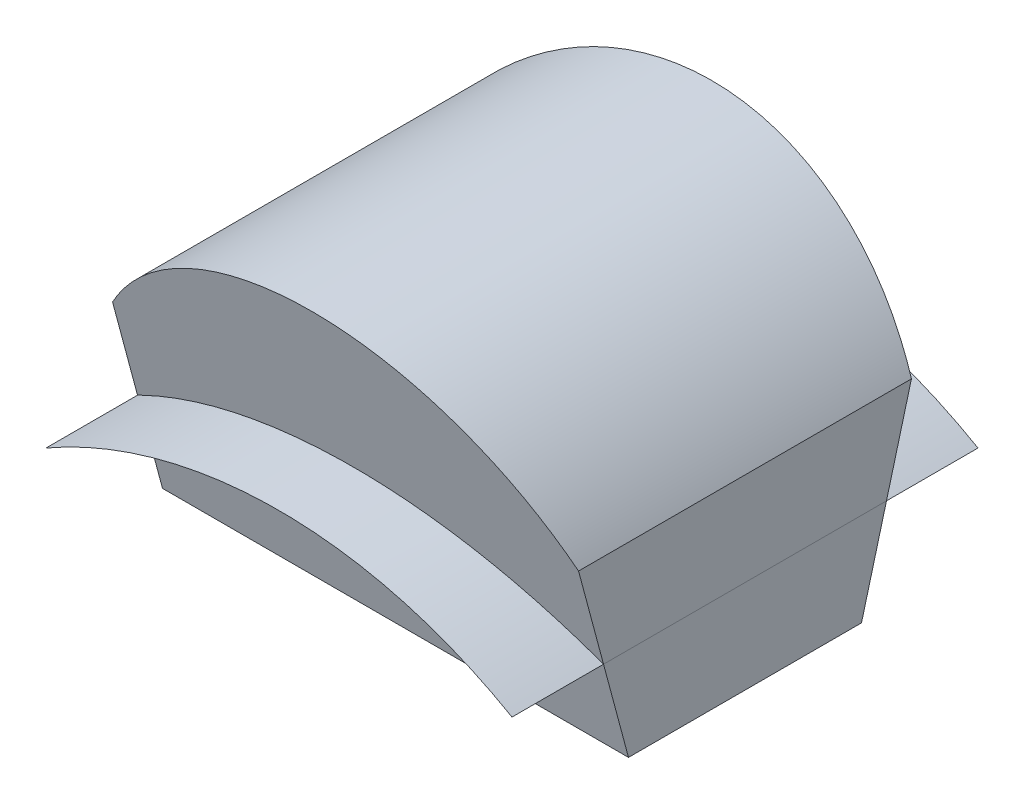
ISO-10303-21;
HEADER;
FILE_DESCRIPTION(('STEP AP214'),'2;1');
FILE_NAME('part.step','',(''),(''),'','','');
FILE_SCHEMA(('AUTOMOTIVE_DESIGN { 1 0 10303 214 1 1 1 1 }'));
ENDSEC;
DATA;
#1=APPLICATION_CONTEXT('core data for automotive mechanical design processes');
#2=APPLICATION_PROTOCOL_DEFINITION('international standard','automotive_design',2000,#1);
#3=PRODUCT_CONTEXT('',#1,'mechanical');
#4=PRODUCT('Part','Part','',(#3));
#5=PRODUCT_RELATED_PRODUCT_CATEGORY('part','',(#4));
#6=PRODUCT_DEFINITION_FORMATION('','',#4);
#7=PRODUCT_DEFINITION_CONTEXT('part definition',#1,'design');
#8=PRODUCT_DEFINITION('design','',#6,#7);
#9=PRODUCT_DEFINITION_SHAPE('','',#8);
#10=(LENGTH_UNIT() NAMED_UNIT(*) SI_UNIT(.MILLI.,.METRE.));
#11=(NAMED_UNIT(*) PLANE_ANGLE_UNIT() SI_UNIT($,.RADIAN.));
#12=(NAMED_UNIT(*) SI_UNIT($,.STERADIAN.) SOLID_ANGLE_UNIT());
#13=UNCERTAINTY_MEASURE_WITH_UNIT(LENGTH_MEASURE(1.E-05),#10,'distance_accuracy_value','');
#14=(GEOMETRIC_REPRESENTATION_CONTEXT(3) GLOBAL_UNCERTAINTY_ASSIGNED_CONTEXT((#13)) GLOBAL_UNIT_ASSIGNED_CONTEXT((#10,
#11,#12)) REPRESENTATION_CONTEXT('',''));
#15=CARTESIAN_POINT('',(0.,0.,0.));
#16=DIRECTION('',(0.,0.,1.));
#17=DIRECTION('',(1.,0.,0.));
#18=AXIS2_PLACEMENT_3D('',#15,#16,#17);
#19=CARTESIAN_POINT('',(0.,-66.6025403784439,-50.));
#20=DIRECTION('',(0.,0.,1.));
#21=DIRECTION('',(1.,0.,0.));
#22=AXIS2_PLACEMENT_3D('',#19,#20,#21);
#23=CYLINDRICAL_SURFACE('',#22,100.);
#24=DIRECTION('',(0.,0.,1.));
#25=VECTOR('',#24,1.);
#26=CARTESIAN_POINT('',(50.,20.,-50.));
#27=LINE('',#26,#25);
#28=CARTESIAN_POINT('',(50.,20.,-30.3589838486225));
#29=VERTEX_POINT('',#28);
#30=CARTESIAN_POINT('',(50.,20.,30.3589838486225));
#31=VERTEX_POINT('',#30);
#32=EDGE_CURVE('E136',#29,#31,#27,.T.);
#33=ORIENTED_EDGE('',*,*,#32,.T.);
#34=CARTESIAN_POINT('',(0.,-66.6025403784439,7.15390309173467));
#35=DIRECTION('',(0.,-0.258819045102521,0.965925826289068));
#36=DIRECTION('',(0.,0.965925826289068,0.258819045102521));
#37=AXIS2_PLACEMENT_3D('',#34,#35,#36);
#38=ELLIPSE('',#37,103.527618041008,100.);
#39=CARTESIAN_POINT('',(-50.,20.,30.3589838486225));
#40=VERTEX_POINT('',#39);
#41=EDGE_CURVE('E205',#31,#40,#38,.T.);
#42=ORIENTED_EDGE('',*,*,#41,.T.);
#43=DIRECTION('',(0.,0.,1.));
#44=VECTOR('',#43,1.);
#45=CARTESIAN_POINT('',(-50.,20.,-50.));
#46=LINE('',#45,#44);
#47=CARTESIAN_POINT('',(-50.,20.,-30.3589838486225));
#48=VERTEX_POINT('',#47);
#49=EDGE_CURVE('E201',#40,#48,#46,.F.);
#50=ORIENTED_EDGE('',*,*,#49,.T.);
#51=CARTESIAN_POINT('',(0.,-66.6025403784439,-7.15390309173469));
#52=DIRECTION('',(0.,-0.258819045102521,-0.965925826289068));
#53=DIRECTION('',(0.,-0.965925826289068,0.258819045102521));
#54=AXIS2_PLACEMENT_3D('',#51,#52,#53);
#55=ELLIPSE('',#54,103.527618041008,100.);
#56=EDGE_CURVE('E199',#29,#48,#55,.F.);
#57=ORIENTED_EDGE('',*,*,#56,.F.);
#58=EDGE_LOOP('',(#33,#42,#50,#57));
#59=FACE_BOUND('',#58,.T.);
#60=CARTESIAN_POINT('',(0.,-66.6025403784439,-6.1186269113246));
#61=DIRECTION('',(0.,-0.258819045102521,-0.965925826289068));
#62=DIRECTION('',(0.,-0.965925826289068,0.258819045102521));
#63=AXIS2_PLACEMENT_3D('',#60,#61,#62);
#64=ELLIPSE('',#63,103.527618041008,100.);
#65=CARTESIAN_POINT('',(-49.,20.5697029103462,-29.4763591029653));
#66=VERTEX_POINT('',#65);
#67=CARTESIAN_POINT('',(49.,20.5697029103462,-29.4763591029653));
#68=VERTEX_POINT('',#67);
#69=EDGE_CURVE('E187',#66,#68,#64,.T.);
#70=ORIENTED_EDGE('',*,*,#69,.F.);
#71=DIRECTION('',(0.,0.,1.));
#72=VECTOR('',#71,1.);
#73=CARTESIAN_POINT('',(-49.,20.5697029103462,-50.));
#74=LINE('',#73,#72);
#75=CARTESIAN_POINT('',(-49.,20.5697029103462,29.4763591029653));
#76=VERTEX_POINT('',#75);
#77=EDGE_CURVE('E183',#66,#76,#74,.T.);
#78=ORIENTED_EDGE('',*,*,#77,.T.);
#79=CARTESIAN_POINT('',(0.,-66.6025403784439,6.11862691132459));
#80=DIRECTION('',(0.,-0.258819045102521,0.965925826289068));
#81=DIRECTION('',(0.,0.965925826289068,0.258819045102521));
#82=AXIS2_PLACEMENT_3D('',#79,#80,#81);
#83=ELLIPSE('',#82,103.527618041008,100.);
#84=CARTESIAN_POINT('',(49.,20.5697029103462,29.4763591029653));
#85=VERTEX_POINT('',#84);
#86=EDGE_CURVE('E175',#76,#85,#83,.F.);
#87=ORIENTED_EDGE('',*,*,#86,.T.);
#88=DIRECTION('',(0.,0.,1.));
#89=VECTOR('',#88,1.);
#90=CARTESIAN_POINT('',(49.,20.5697029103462,-50.));
#91=LINE('',#90,#89);
#92=EDGE_CURVE('E179',#85,#68,#91,.F.);
#93=ORIENTED_EDGE('',*,*,#92,.T.);
#94=EDGE_LOOP('',(#70,#78,#87,#93));
#95=FACE_BOUND('',#94,.T.);
#96=ADVANCED_FACE('F51',(#59,#95),#23,.F.);
#97=CARTESIAN_POINT('',(0.,-66.6025403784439,-50.));
#98=DIRECTION('',(0.,0.,1.));
#99=DIRECTION('',(1.,0.,0.));
#100=AXIS2_PLACEMENT_3D('',#97,#98,#99);
#101=CYLINDRICAL_SURFACE('',#100,101.);
#102=DIRECTION('',(0.,0.,1.));
#103=VECTOR('',#102,1.);
#104=CARTESIAN_POINT('',(-49.,21.7150682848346,-50.));
#105=LINE('',#104,#103);
#106=CARTESIAN_POINT('',(-49.,21.7150682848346,29.783258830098));
#107=VERTEX_POINT('',#106);
#108=CARTESIAN_POINT('',(-49.,21.7150682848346,-29.7832588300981));
#109=VERTEX_POINT('',#108);
#110=EDGE_CURVE('E163',#107,#109,#105,.F.);
#111=ORIENTED_EDGE('',*,*,#110,.T.);
#112=CARTESIAN_POINT('',(0.,-66.6025403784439,-6.1186269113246));
#113=DIRECTION('',(0.,-0.258819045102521,-0.965925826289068));
#114=DIRECTION('',(0.,-0.965925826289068,0.258819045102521));
#115=AXIS2_PLACEMENT_3D('',#112,#113,#114);
#116=ELLIPSE('',#115,104.562894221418,101.);
#117=CARTESIAN_POINT('',(49.,21.7150682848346,-29.7832588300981));
#118=VERTEX_POINT('',#117);
#119=EDGE_CURVE('E160',#118,#109,#116,.F.);
#120=ORIENTED_EDGE('',*,*,#119,.F.);
#121=DIRECTION('',(0.,0.,1.));
#122=VECTOR('',#121,1.);
#123=CARTESIAN_POINT('',(49.,21.7150682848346,-50.));
#124=LINE('',#123,#122);
#125=CARTESIAN_POINT('',(49.,21.7150682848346,29.7832588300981));
#126=VERTEX_POINT('',#125);
#127=EDGE_CURVE('E167',#118,#126,#124,.T.);
#128=ORIENTED_EDGE('',*,*,#127,.T.);
#129=CARTESIAN_POINT('',(0.,-66.6025403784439,6.11862691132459));
#130=DIRECTION('',(0.,-0.258819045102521,0.965925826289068));
#131=DIRECTION('',(0.,0.965925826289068,0.258819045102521));
#132=AXIS2_PLACEMENT_3D('',#129,#130,#131);
#133=ELLIPSE('',#132,104.562894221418,101.);
#134=EDGE_CURVE('E171',#126,#107,#133,.T.);
#135=ORIENTED_EDGE('',*,*,#134,.T.);
#136=EDGE_LOOP('',(#111,#120,#128,#135));
#137=FACE_BOUND('',#136,.T.);
#138=CARTESIAN_POINT('',(0.,-66.6025403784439,5.08335073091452));
#139=DIRECTION('',(0.,-0.258819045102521,0.965925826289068));
#140=DIRECTION('',(0.,0.965925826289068,0.258819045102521));
#141=AXIS2_PLACEMENT_3D('',#138,#139,#140);
#142=ELLIPSE('',#141,104.562894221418,101.);
#143=CARTESIAN_POINT('',(48.,22.2625258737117,28.8946734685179));
#144=VERTEX_POINT('',#143);
#145=CARTESIAN_POINT('',(-48.,22.2625258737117,28.8946734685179));
#146=VERTEX_POINT('',#145);
#147=EDGE_CURVE('E190',#144,#146,#142,.T.);
#148=ORIENTED_EDGE('',*,*,#147,.F.);
#149=DIRECTION('',(0.,0.,1.));
#150=VECTOR('',#149,1.);
#151=CARTESIAN_POINT('',(48.,22.2625258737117,-50.));
#152=LINE('',#151,#150);
#153=CARTESIAN_POINT('',(48.,22.2625258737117,-28.8946734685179));
#154=VERTEX_POINT('',#153);
#155=EDGE_CURVE('E193',#154,#144,#152,.T.);
#156=ORIENTED_EDGE('',*,*,#155,.F.);
#157=CARTESIAN_POINT('',(0.,-66.6025403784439,-5.08335073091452));
#158=DIRECTION('',(0.,-0.258819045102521,-0.965925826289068));
#159=DIRECTION('',(0.,-0.965925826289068,0.258819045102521));
#160=AXIS2_PLACEMENT_3D('',#157,#158,#159);
#161=ELLIPSE('',#160,104.562894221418,101.);
#162=CARTESIAN_POINT('',(-48.,22.2625258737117,-28.8946734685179));
#163=VERTEX_POINT('',#162);
#164=EDGE_CURVE('E208',#154,#163,#161,.F.);
#165=ORIENTED_EDGE('',*,*,#164,.T.);
#166=DIRECTION('',(0.,0.,1.));
#167=VECTOR('',#166,1.);
#168=CARTESIAN_POINT('',(-48.,22.2625258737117,-50.));
#169=LINE('',#168,#167);
#170=EDGE_CURVE('E196',#146,#163,#169,.F.);
#171=ORIENTED_EDGE('',*,*,#170,.F.);
#172=EDGE_LOOP('',(#148,#156,#165,#171));
#173=FACE_BOUND('',#172,.T.);
#174=ADVANCED_FACE('F248',(#137,#173),#101,.F.);
#175=CARTESIAN_POINT('',(-49.,0.,25.));
#176=DIRECTION('',(1.,0.,0.));
#177=DIRECTION('',(0.,0.,-1.));
#178=AXIS2_PLACEMENT_3D('',#175,#176,#177);
#179=PLANE('',#178);
#180=DIRECTION('',(0.,0.965925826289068,0.258819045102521));
#181=VECTOR('',#180,1.);
#182=CARTESIAN_POINT('',(-49.,0.258819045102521,24.0340741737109));
#183=LINE('',#182,#181);
#184=EDGE_CURVE('E12',#107,#76,#183,.F.);
#185=ORIENTED_EDGE('',*,*,#184,.T.);
#186=ORIENTED_EDGE('',*,*,#77,.F.);
#187=DIRECTION('',(0.,-0.965925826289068,0.258819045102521));
#188=VECTOR('',#187,1.);
#189=CARTESIAN_POINT('',(-49.,0.258819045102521,-24.0340741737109));
#190=LINE('',#189,#188);
#191=EDGE_CURVE('E158',#109,#66,#190,.T.);
#192=ORIENTED_EDGE('',*,*,#191,.F.);
#193=ORIENTED_EDGE('',*,*,#110,.F.);
#194=EDGE_LOOP('',(#185,#186,#192,#193));
#195=FACE_BOUND('',#194,.T.);
#196=ADVANCED_FACE('F246',(#195),#179,.T.);
#197=CARTESIAN_POINT('',(-50.,0.258819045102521,-24.0340741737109));
#198=DIRECTION('',(0.,-0.258819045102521,-0.965925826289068));
#199=DIRECTION('',(0.,0.965925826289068,-0.258819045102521));
#200=AXIS2_PLACEMENT_3D('',#197,#198,#199);
#201=PLANE('',#200);
#202=ORIENTED_EDGE('',*,*,#119,.T.);
#203=ORIENTED_EDGE('',*,*,#191,.T.);
#204=ORIENTED_EDGE('',*,*,#69,.T.);
#205=DIRECTION('',(0.,0.965925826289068,-0.258819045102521));
#206=VECTOR('',#205,1.);
#207=CARTESIAN_POINT('',(49.,0.258819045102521,-24.0340741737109));
#208=LINE('',#207,#206);
#209=EDGE_CURVE('E70',#68,#118,#208,.T.);
#210=ORIENTED_EDGE('',*,*,#209,.T.);
#211=EDGE_LOOP('',(#202,#203,#204,#210));
#212=FACE_BOUND('',#211,.T.);
#213=ADVANCED_FACE('F255',(#212),#201,.F.);
#214=CARTESIAN_POINT('',(49.,0.,25.));
#215=DIRECTION('',(-1.,0.,0.));
#216=DIRECTION('',(0.,0.,1.));
#217=AXIS2_PLACEMENT_3D('',#214,#215,#216);
#218=PLANE('',#217);
#219=ORIENTED_EDGE('',*,*,#209,.F.);
#220=ORIENTED_EDGE('',*,*,#92,.F.);
#221=DIRECTION('',(0.,-0.965925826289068,-0.258819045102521));
#222=VECTOR('',#221,1.);
#223=CARTESIAN_POINT('',(49.,0.258819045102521,24.0340741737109));
#224=LINE('',#223,#222);
#225=EDGE_CURVE('E61',#85,#126,#224,.F.);
#226=ORIENTED_EDGE('',*,*,#225,.T.);
#227=ORIENTED_EDGE('',*,*,#127,.F.);
#228=EDGE_LOOP('',(#219,#220,#226,#227));
#229=FACE_BOUND('',#228,.T.);
#230=ADVANCED_FACE('F252',(#229),#218,.T.);
#231=CARTESIAN_POINT('',(-50.,0.258819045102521,24.0340741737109));
#232=DIRECTION('',(0.,-0.258819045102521,0.965925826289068));
#233=DIRECTION('',(0.,-0.965925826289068,-0.258819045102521));
#234=AXIS2_PLACEMENT_3D('',#231,#232,#233);
#235=PLANE('',#234);
#236=ORIENTED_EDGE('',*,*,#225,.F.);
#237=ORIENTED_EDGE('',*,*,#86,.F.);
#238=ORIENTED_EDGE('',*,*,#184,.F.);
#239=ORIENTED_EDGE('',*,*,#134,.F.);
#240=EDGE_LOOP('',(#236,#237,#238,#239));
#241=FACE_BOUND('',#240,.T.);
#242=ADVANCED_FACE('F243',(#241),#235,.F.);
#243=CARTESIAN_POINT('',(-48.,0.,25.));
#244=DIRECTION('',(1.,0.,0.));
#245=DIRECTION('',(0.,0.,-1.));
#246=AXIS2_PLACEMENT_3D('',#243,#244,#245);
#247=PLANE('',#246);
#248=DIRECTION('',(0.,0.965925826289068,0.258819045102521));
#249=VECTOR('',#248,1.);
#250=CARTESIAN_POINT('',(-48.,0.517638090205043,23.0681483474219));
#251=LINE('',#250,#249);
#252=CARTESIAN_POINT('',(-48.,39.3913932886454,33.4843396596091));
#253=VERTEX_POINT('',#252);
#254=EDGE_CURVE('E213',#253,#146,#251,.F.);
#255=ORIENTED_EDGE('',*,*,#254,.T.);
#256=ORIENTED_EDGE('',*,*,#170,.T.);
#257=DIRECTION('',(0.,-0.965925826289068,0.258819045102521));
#258=VECTOR('',#257,1.);
#259=CARTESIAN_POINT('',(-48.,0.517638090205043,-23.0681483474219));
#260=LINE('',#259,#258);
#261=CARTESIAN_POINT('',(-48.,39.3913932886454,-33.4843396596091));
#262=VERTEX_POINT('',#261);
#263=EDGE_CURVE('E141',#262,#163,#260,.T.);
#264=ORIENTED_EDGE('',*,*,#263,.F.);
#265=DIRECTION('',(0.,0.,-1.));
#266=VECTOR('',#265,1.);
#267=CARTESIAN_POINT('',(-48.,39.3913932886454,33.4843396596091));
#268=LINE('',#267,#266);
#269=EDGE_CURVE('E219',#253,#262,#268,.T.);
#270=ORIENTED_EDGE('',*,*,#269,.F.);
#271=EDGE_LOOP('',(#255,#256,#264,#270));
#272=FACE_BOUND('',#271,.T.);
#273=ADVANCED_FACE('F270',(#272),#247,.T.);
#274=CARTESIAN_POINT('',(48.,0.,25.));
#275=DIRECTION('',(-1.,0.,0.));
#276=DIRECTION('',(0.,0.,1.));
#277=AXIS2_PLACEMENT_3D('',#274,#275,#276);
#278=PLANE('',#277);
#279=DIRECTION('',(0.,0.965925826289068,-0.258819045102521));
#280=VECTOR('',#279,1.);
#281=CARTESIAN_POINT('',(48.,0.517638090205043,-23.0681483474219));
#282=LINE('',#281,#280);
#283=CARTESIAN_POINT('',(48.,39.3913932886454,-33.4843396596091));
#284=VERTEX_POINT('',#283);
#285=EDGE_CURVE('E217',#154,#284,#282,.T.);
#286=ORIENTED_EDGE('',*,*,#285,.F.);
#287=ORIENTED_EDGE('',*,*,#155,.T.);
#288=DIRECTION('',(0.,-0.965925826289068,-0.258819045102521));
#289=VECTOR('',#288,1.);
#290=CARTESIAN_POINT('',(48.,0.517638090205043,23.0681483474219));
#291=LINE('',#290,#289);
#292=CARTESIAN_POINT('',(48.,39.3913932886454,33.4843396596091));
#293=VERTEX_POINT('',#292);
#294=EDGE_CURVE('E211',#144,#293,#291,.F.);
#295=ORIENTED_EDGE('',*,*,#294,.T.);
#296=DIRECTION('',(0.,0.,-1.));
#297=VECTOR('',#296,1.);
#298=CARTESIAN_POINT('',(48.,39.3913932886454,33.4843396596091));
#299=LINE('',#298,#297);
#300=EDGE_CURVE('E216',#293,#284,#299,.T.);
#301=ORIENTED_EDGE('',*,*,#300,.T.);
#302=EDGE_LOOP('',(#286,#287,#295,#301));
#303=FACE_BOUND('',#302,.T.);
#304=ADVANCED_FACE('F272',(#303),#278,.T.);
#305=CARTESIAN_POINT('',(0.,6.83375209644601,25.));
#306=DIRECTION('',(0.,0.,-1.));
#307=DIRECTION('',(-1.,0.,0.));
#308=AXIS2_PLACEMENT_3D('',#305,#306,#307);
#309=CYLINDRICAL_SURFACE('',#308,58.);
#310=CARTESIAN_POINT('',(0.,6.83375209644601,-24.760545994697));
#311=DIRECTION('',(0.,-0.258819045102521,-0.965925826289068));
#312=DIRECTION('',(0.,0.965925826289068,-0.258819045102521));
#313=AXIS2_PLACEMENT_3D('',#310,#311,#312);
#314=ELLIPSE('',#313,60.0460184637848,58.);
#315=EDGE_CURVE('E220',#284,#262,#314,.F.);
#316=ORIENTED_EDGE('',*,*,#315,.F.);
#317=ORIENTED_EDGE('',*,*,#300,.F.);
#318=CARTESIAN_POINT('',(0.,6.83375209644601,24.760545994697));
#319=DIRECTION('',(0.,-0.258819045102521,0.965925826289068));
#320=DIRECTION('',(0.,-0.965925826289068,-0.258819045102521));
#321=AXIS2_PLACEMENT_3D('',#318,#319,#320);
#322=ELLIPSE('',#321,60.0460184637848,58.);
#323=EDGE_CURVE('E192',#293,#253,#322,.T.);
#324=ORIENTED_EDGE('',*,*,#323,.T.);
#325=ORIENTED_EDGE('',*,*,#269,.T.);
#326=EDGE_LOOP('',(#316,#317,#324,#325));
#327=FACE_BOUND('',#326,.T.);
#328=ADVANCED_FACE('F279',(#327),#309,.F.);
#329=CARTESIAN_POINT('',(-50.,0.517638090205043,23.0681483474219));
#330=DIRECTION('',(0.,-0.258819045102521,0.965925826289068));
#331=DIRECTION('',(0.,-0.965925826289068,-0.258819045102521));
#332=AXIS2_PLACEMENT_3D('',#329,#330,#331);
#333=PLANE('',#332);
#334=ORIENTED_EDGE('',*,*,#294,.F.);
#335=ORIENTED_EDGE('',*,*,#147,.T.);
#336=ORIENTED_EDGE('',*,*,#254,.F.);
#337=ORIENTED_EDGE('',*,*,#323,.F.);
#338=EDGE_LOOP('',(#334,#335,#336,#337));
#339=FACE_BOUND('',#338,.T.);
#340=ADVANCED_FACE('F286',(#339),#333,.F.);
#341=CARTESIAN_POINT('',(-50.,0.517638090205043,-23.0681483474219));
#342=DIRECTION('',(0.,-0.258819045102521,-0.965925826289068));
#343=DIRECTION('',(0.,0.965925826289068,-0.258819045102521));
#344=AXIS2_PLACEMENT_3D('',#341,#342,#343);
#345=PLANE('',#344);
#346=ORIENTED_EDGE('',*,*,#164,.F.);
#347=ORIENTED_EDGE('',*,*,#285,.T.);
#348=ORIENTED_EDGE('',*,*,#315,.T.);
#349=ORIENTED_EDGE('',*,*,#263,.T.);
#350=EDGE_LOOP('',(#346,#347,#348,#349));
#351=FACE_BOUND('',#350,.T.);
#352=ADVANCED_FACE('F267',(#351),#345,.F.);
#353=CARTESIAN_POINT('',(0.,6.83375209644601,25.));
#354=DIRECTION('',(0.,0.,-1.));
#355=DIRECTION('',(-1.,0.,0.));
#356=AXIS2_PLACEMENT_3D('',#353,#354,#355);
#357=CYLINDRICAL_SURFACE('',#356,60.);
#358=CARTESIAN_POINT('',(0.,6.83375209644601,-26.8310983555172));
#359=DIRECTION('',(0.,-0.258819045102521,-0.965925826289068));
#360=DIRECTION('',(0.,0.965925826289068,-0.258819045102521));
#361=AXIS2_PLACEMENT_3D('',#358,#359,#360);
#362=ELLIPSE('',#361,62.116570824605,60.);
#363=CARTESIAN_POINT('',(50.,40.,-35.7179676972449));
#364=VERTEX_POINT('',#363);
#365=CARTESIAN_POINT('',(-50.,40.,-35.7179676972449));
#366=VERTEX_POINT('',#365);
#367=EDGE_CURVE('E124',#364,#366,#362,.F.);
#368=ORIENTED_EDGE('',*,*,#367,.T.);
#369=DIRECTION('',(0.,0.,-1.));
#370=VECTOR('',#369,1.);
#371=CARTESIAN_POINT('',(-50.,40.,25.));
#372=LINE('',#371,#370);
#373=CARTESIAN_POINT('',(-50.,40.,35.7179676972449));
#374=VERTEX_POINT('',#373);
#375=EDGE_CURVE('E140',#374,#366,#372,.T.);
#376=ORIENTED_EDGE('',*,*,#375,.F.);
#377=CARTESIAN_POINT('',(0.,6.83375209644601,26.8310983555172));
#378=DIRECTION('',(0.,-0.258819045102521,0.965925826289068));
#379=DIRECTION('',(0.,-0.965925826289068,-0.258819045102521));
#380=AXIS2_PLACEMENT_3D('',#377,#378,#379);
#381=ELLIPSE('',#380,62.116570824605,60.);
#382=CARTESIAN_POINT('',(50.,40.,35.7179676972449));
#383=VERTEX_POINT('',#382);
#384=EDGE_CURVE('E139',#383,#374,#381,.T.);
#385=ORIENTED_EDGE('',*,*,#384,.F.);
#386=DIRECTION('',(0.,0.,-1.));
#387=VECTOR('',#386,1.);
#388=CARTESIAN_POINT('',(50.,40.,25.));
#389=LINE('',#388,#387);
#390=EDGE_CURVE('E133',#383,#364,#389,.T.);
#391=ORIENTED_EDGE('',*,*,#390,.T.);
#392=EDGE_LOOP('',(#368,#376,#385,#391));
#393=FACE_BOUND('',#392,.T.);
#394=ADVANCED_FACE('F138',(#393),#357,.T.);
#395=CARTESIAN_POINT('',(-50.,0.,25.));
#396=DIRECTION('',(1.,0.,0.));
#397=DIRECTION('',(0.,0.,-1.));
#398=AXIS2_PLACEMENT_3D('',#395,#396,#397);
#399=PLANE('',#398);
#400=ORIENTED_EDGE('',*,*,#49,.F.);
#401=DIRECTION('',(0.,0.965925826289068,0.258819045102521));
#402=VECTOR('',#401,1.);
#403=CARTESIAN_POINT('',(-50.,0.,25.));
#404=LINE('',#403,#402);
#405=EDGE_CURVE('E146',#374,#40,#404,.F.);
#406=ORIENTED_EDGE('',*,*,#405,.F.);
#407=ORIENTED_EDGE('',*,*,#375,.T.);
#408=DIRECTION('',(0.,-0.965925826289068,0.258819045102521));
#409=VECTOR('',#408,1.);
#410=CARTESIAN_POINT('',(-50.,0.,-25.));
#411=LINE('',#410,#409);
#412=EDGE_CURVE('E55',#366,#48,#411,.T.);
#413=ORIENTED_EDGE('',*,*,#412,.T.);
#414=EDGE_LOOP('',(#400,#406,#407,#413));
#415=FACE_BOUND('',#414,.T.);
#416=ADVANCED_FACE('F230',(#415),#399,.F.);
#417=CARTESIAN_POINT('',(50.,0.,25.));
#418=DIRECTION('',(-1.,0.,0.));
#419=DIRECTION('',(0.,0.,1.));
#420=AXIS2_PLACEMENT_3D('',#417,#418,#419);
#421=PLANE('',#420);
#422=ORIENTED_EDGE('',*,*,#32,.F.);
#423=DIRECTION('',(0.,0.965925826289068,-0.258819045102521));
#424=VECTOR('',#423,1.);
#425=CARTESIAN_POINT('',(50.,0.,-25.));
#426=LINE('',#425,#424);
#427=EDGE_CURVE('E131',#29,#364,#426,.T.);
#428=ORIENTED_EDGE('',*,*,#427,.T.);
#429=ORIENTED_EDGE('',*,*,#390,.F.);
#430=DIRECTION('',(0.,-0.965925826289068,-0.258819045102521));
#431=VECTOR('',#430,1.);
#432=CARTESIAN_POINT('',(50.,0.,25.));
#433=LINE('',#432,#431);
#434=EDGE_CURVE('E149',#31,#383,#433,.F.);
#435=ORIENTED_EDGE('',*,*,#434,.F.);
#436=EDGE_LOOP('',(#422,#428,#429,#435));
#437=FACE_BOUND('',#436,.T.);
#438=ADVANCED_FACE('F53',(#437),#421,.F.);
#439=CARTESIAN_POINT('',(-50.,0.,-25.));
#440=DIRECTION('',(0.,-0.258819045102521,-0.965925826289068));
#441=DIRECTION('',(0.,0.965925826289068,-0.258819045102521));
#442=AXIS2_PLACEMENT_3D('',#439,#440,#441);
#443=PLANE('',#442);
#444=ORIENTED_EDGE('',*,*,#427,.F.);
#445=ORIENTED_EDGE('',*,*,#56,.T.);
#446=ORIENTED_EDGE('',*,*,#412,.F.);
#447=ORIENTED_EDGE('',*,*,#367,.F.);
#448=EDGE_LOOP('',(#444,#445,#446,#447));
#449=FACE_BOUND('',#448,.T.);
#450=ADVANCED_FACE('F144',(#449),#443,.T.);
#451=CARTESIAN_POINT('',(-50.,0.,25.));
#452=DIRECTION('',(0.,-0.258819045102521,0.965925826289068));
#453=DIRECTION('',(0.,-0.965925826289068,-0.258819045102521));
#454=AXIS2_PLACEMENT_3D('',#451,#452,#453);
#455=PLANE('',#454);
#456=ORIENTED_EDGE('',*,*,#41,.F.);
#457=ORIENTED_EDGE('',*,*,#434,.T.);
#458=ORIENTED_EDGE('',*,*,#384,.T.);
#459=ORIENTED_EDGE('',*,*,#405,.T.);
#460=EDGE_LOOP('',(#456,#457,#458,#459));
#461=FACE_BOUND('',#460,.T.);
#462=ADVANCED_FACE('F225',(#461),#455,.T.);
#463=CLOSED_SHELL('',(#96,#174,#196,#213,#230,#242,#273,#304,#328,#340,#352,#394,#416,#438,#450,#462));
#464=MANIFOLD_SOLID_BREP('B2',#463);
#465=CARTESIAN_POINT('',(0.,-66.6025403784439,-50.));
#466=DIRECTION('',(0.,0.,1.));
#467=DIRECTION('',(1.,0.,0.));
#468=AXIS2_PLACEMENT_3D('',#465,#466,#467);
#469=CYLINDRICAL_SURFACE('',#468,101.);
#470=CARTESIAN_POINT('',(0.,-66.6025403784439,5.08335073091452));
#471=DIRECTION('',(0.,-0.258819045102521,0.965925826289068));
#472=DIRECTION('',(0.,0.965925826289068,0.258819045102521));
#473=AXIS2_PLACEMENT_3D('',#470,#471,#472);
#474=ELLIPSE('',#473,104.562894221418,101.);
#475=CARTESIAN_POINT('',(48.,22.2625258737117,28.8946734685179));
#476=VERTEX_POINT('',#475);
#477=CARTESIAN_POINT('',(-48.,22.2625258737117,28.8946734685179));
#478=VERTEX_POINT('',#477);
#479=EDGE_CURVE('E641',#476,#478,#474,.T.);
#480=ORIENTED_EDGE('',*,*,#479,.T.);
#481=DIRECTION('',(0.,0.,1.));
#482=VECTOR('',#481,1.);
#483=CARTESIAN_POINT('',(-48.,22.2625258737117,-50.));
#484=LINE('',#483,#482);
#485=CARTESIAN_POINT('',(-48.,22.2625258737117,-28.8946734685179));
#486=VERTEX_POINT('',#485);
#487=EDGE_CURVE('E620',#478,#486,#484,.F.);
#488=ORIENTED_EDGE('',*,*,#487,.T.);
#489=CARTESIAN_POINT('',(0.,-66.6025403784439,-5.08335073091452));
#490=DIRECTION('',(0.,-0.258819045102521,-0.965925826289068));
#491=DIRECTION('',(0.,-0.965925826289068,0.258819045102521));
#492=AXIS2_PLACEMENT_3D('',#489,#490,#491);
#493=ELLIPSE('',#492,104.562894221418,101.);
#494=CARTESIAN_POINT('',(48.,22.2625258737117,-28.8946734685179));
#495=VERTEX_POINT('',#494);
#496=EDGE_CURVE('E601',#495,#486,#493,.F.);
#497=ORIENTED_EDGE('',*,*,#496,.F.);
#498=DIRECTION('',(0.,0.,1.));
#499=VECTOR('',#498,1.);
#500=CARTESIAN_POINT('',(48.,22.2625258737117,-50.));
#501=LINE('',#500,#499);
#502=EDGE_CURVE('E657',#495,#476,#501,.T.);
#503=ORIENTED_EDGE('',*,*,#502,.T.);
#504=EDGE_LOOP('',(#480,#488,#497,#503));
#505=FACE_BOUND('',#504,.T.);
#506=DIRECTION('',(0.,0.,1.));
#507=VECTOR('',#506,1.);
#508=CARTESIAN_POINT('',(-49.,21.7150682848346,-50.));
#509=LINE('',#508,#507);
#510=CARTESIAN_POINT('',(-49.,21.7150682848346,29.783258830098));
#511=VERTEX_POINT('',#510);
#512=CARTESIAN_POINT('',(-49.,21.7150682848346,-29.7832588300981));
#513=VERTEX_POINT('',#512);
#514=EDGE_CURVE('E650',#511,#513,#509,.F.);
#515=ORIENTED_EDGE('',*,*,#514,.F.);
#516=CARTESIAN_POINT('',(0.,-66.6025403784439,6.11862691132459));
#517=DIRECTION('',(0.,-0.258819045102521,0.965925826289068));
#518=DIRECTION('',(0.,0.965925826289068,0.258819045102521));
#519=AXIS2_PLACEMENT_3D('',#516,#517,#518);
#520=ELLIPSE('',#519,104.562894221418,101.);
#521=CARTESIAN_POINT('',(49.,21.7150682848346,29.7832588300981));
#522=VERTEX_POINT('',#521);
#523=EDGE_CURVE('E631',#522,#511,#520,.T.);
#524=ORIENTED_EDGE('',*,*,#523,.F.);
#525=DIRECTION('',(0.,0.,1.));
#526=VECTOR('',#525,1.);
#527=CARTESIAN_POINT('',(49.,21.7150682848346,-50.));
#528=LINE('',#527,#526);
#529=CARTESIAN_POINT('',(49.,21.7150682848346,-29.7832588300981));
#530=VERTEX_POINT('',#529);
#531=EDGE_CURVE('E653',#530,#522,#528,.T.);
#532=ORIENTED_EDGE('',*,*,#531,.F.);
#533=CARTESIAN_POINT('',(0.,-66.6025403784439,-6.1186269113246));
#534=DIRECTION('',(0.,-0.258819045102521,-0.965925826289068));
#535=DIRECTION('',(0.,-0.965925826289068,0.258819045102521));
#536=AXIS2_PLACEMENT_3D('',#533,#534,#535);
#537=ELLIPSE('',#536,104.562894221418,101.);
#538=EDGE_CURVE('E493',#530,#513,#537,.F.);
#539=ORIENTED_EDGE('',*,*,#538,.T.);
#540=EDGE_LOOP('',(#515,#524,#532,#539));
#541=FACE_BOUND('',#540,.T.);
#542=ADVANCED_FACE('F477',(#505,#541),#469,.T.);
#543=CARTESIAN_POINT('',(-50.,0.258819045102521,-24.0340741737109));
#544=DIRECTION('',(0.,-0.258819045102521,-0.965925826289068));
#545=DIRECTION('',(0.,0.965925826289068,-0.258819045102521));
#546=AXIS2_PLACEMENT_3D('',#543,#544,#545);
#547=PLANE('',#546);
#548=ORIENTED_EDGE('',*,*,#538,.F.);
#549=DIRECTION('',(0.,0.965925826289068,-0.258819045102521));
#550=VECTOR('',#549,1.);
#551=CARTESIAN_POINT('',(49.,0.258819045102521,-24.0340741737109));
#552=LINE('',#551,#550);
#553=CARTESIAN_POINT('',(49.,20.5697029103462,-29.4763591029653));
#554=VERTEX_POINT('',#553);
#555=EDGE_CURVE('E643',#554,#530,#552,.T.);
#556=ORIENTED_EDGE('',*,*,#555,.F.);
#557=CARTESIAN_POINT('',(0.,-66.6025403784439,-6.1186269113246));
#558=DIRECTION('',(0.,-0.258819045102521,-0.965925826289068));
#559=DIRECTION('',(0.,-0.965925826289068,0.258819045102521));
#560=AXIS2_PLACEMENT_3D('',#557,#558,#559);
#561=ELLIPSE('',#560,103.527618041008,100.);
#562=CARTESIAN_POINT('',(-49.,20.5697029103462,-29.4763591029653));
#563=VERTEX_POINT('',#562);
#564=EDGE_CURVE('E638',#563,#554,#561,.T.);
#565=ORIENTED_EDGE('',*,*,#564,.F.);
#566=DIRECTION('',(0.,-0.965925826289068,0.258819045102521));
#567=VECTOR('',#566,1.);
#568=CARTESIAN_POINT('',(-49.,0.258819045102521,-24.0340741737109));
#569=LINE('',#568,#567);
#570=EDGE_CURVE('E642',#513,#563,#569,.T.);
#571=ORIENTED_EDGE('',*,*,#570,.F.);
#572=EDGE_LOOP('',(#548,#556,#565,#571));
#573=FACE_BOUND('',#572,.T.);
#574=ADVANCED_FACE('F693',(#573),#547,.T.);
#575=CARTESIAN_POINT('',(-49.,0.,25.));
#576=DIRECTION('',(1.,0.,0.));
#577=DIRECTION('',(0.,0.,-1.));
#578=AXIS2_PLACEMENT_3D('',#575,#576,#577);
#579=PLANE('',#578);
#580=DIRECTION('',(0.,0.965925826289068,0.258819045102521));
#581=VECTOR('',#580,1.);
#582=CARTESIAN_POINT('',(-49.,0.258819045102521,24.0340741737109));
#583=LINE('',#582,#581);
#584=CARTESIAN_POINT('',(-49.,20.5697029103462,29.4763591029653));
#585=VERTEX_POINT('',#584);
#586=EDGE_CURVE('E49',#511,#585,#583,.F.);
#587=ORIENTED_EDGE('',*,*,#586,.F.);
#588=ORIENTED_EDGE('',*,*,#514,.T.);
#589=ORIENTED_EDGE('',*,*,#570,.T.);
#590=DIRECTION('',(0.,0.,1.));
#591=VECTOR('',#590,1.);
#592=CARTESIAN_POINT('',(-49.,20.5697029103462,-50.));
#593=LINE('',#592,#591);
#594=EDGE_CURVE('E635',#563,#585,#593,.T.);
#595=ORIENTED_EDGE('',*,*,#594,.T.);
#596=EDGE_LOOP('',(#587,#588,#589,#595));
#597=FACE_BOUND('',#596,.T.);
#598=ADVANCED_FACE('F698',(#597),#579,.F.);
#599=CARTESIAN_POINT('',(49.,0.,25.));
#600=DIRECTION('',(-1.,0.,0.));
#601=DIRECTION('',(0.,0.,1.));
#602=AXIS2_PLACEMENT_3D('',#599,#600,#601);
#603=PLANE('',#602);
#604=ORIENTED_EDGE('',*,*,#555,.T.);
#605=ORIENTED_EDGE('',*,*,#531,.T.);
#606=DIRECTION('',(0.,-0.965925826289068,-0.258819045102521));
#607=VECTOR('',#606,1.);
#608=CARTESIAN_POINT('',(49.,0.258819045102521,24.0340741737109));
#609=LINE('',#608,#607);
#610=CARTESIAN_POINT('',(49.,20.5697029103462,29.4763591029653));
#611=VERTEX_POINT('',#610);
#612=EDGE_CURVE('E485',#611,#522,#609,.F.);
#613=ORIENTED_EDGE('',*,*,#612,.F.);
#614=DIRECTION('',(0.,0.,1.));
#615=VECTOR('',#614,1.);
#616=CARTESIAN_POINT('',(49.,20.5697029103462,-50.));
#617=LINE('',#616,#615);
#618=EDGE_CURVE('E632',#611,#554,#617,.F.);
#619=ORIENTED_EDGE('',*,*,#618,.T.);
#620=EDGE_LOOP('',(#604,#605,#613,#619));
#621=FACE_BOUND('',#620,.T.);
#622=ADVANCED_FACE('F703',(#621),#603,.F.);
#623=CARTESIAN_POINT('',(-50.,0.258819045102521,24.0340741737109));
#624=DIRECTION('',(0.,-0.258819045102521,0.965925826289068));
#625=DIRECTION('',(0.,-0.965925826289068,-0.258819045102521));
#626=AXIS2_PLACEMENT_3D('',#623,#624,#625);
#627=PLANE('',#626);
#628=ORIENTED_EDGE('',*,*,#612,.T.);
#629=ORIENTED_EDGE('',*,*,#523,.T.);
#630=ORIENTED_EDGE('',*,*,#586,.T.);
#631=CARTESIAN_POINT('',(0.,-66.6025403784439,6.11862691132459));
#632=DIRECTION('',(0.,-0.258819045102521,0.965925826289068));
#633=DIRECTION('',(0.,0.965925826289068,0.258819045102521));
#634=AXIS2_PLACEMENT_3D('',#631,#632,#633);
#635=ELLIPSE('',#634,103.527618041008,100.);
#636=EDGE_CURVE('E628',#585,#611,#635,.F.);
#637=ORIENTED_EDGE('',*,*,#636,.T.);
#638=EDGE_LOOP('',(#628,#629,#630,#637));
#639=FACE_BOUND('',#638,.T.);
#640=ADVANCED_FACE('F709',(#639),#627,.T.);
#641=CARTESIAN_POINT('',(0.,-66.6025403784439,-50.));
#642=DIRECTION('',(0.,0.,1.));
#643=DIRECTION('',(1.,0.,0.));
#644=AXIS2_PLACEMENT_3D('',#641,#642,#643);
#645=CYLINDRICAL_SURFACE('',#644,100.);
#646=ORIENTED_EDGE('',*,*,#564,.T.);
#647=ORIENTED_EDGE('',*,*,#618,.F.);
#648=ORIENTED_EDGE('',*,*,#636,.F.);
#649=ORIENTED_EDGE('',*,*,#594,.F.);
#650=EDGE_LOOP('',(#646,#647,#648,#649));
#651=FACE_BOUND('',#650,.T.);
#652=DIRECTION('',(0.,0.,1.));
#653=VECTOR('',#652,1.);
#654=CARTESIAN_POINT('',(50.,20.,-50.));
#655=LINE('',#654,#653);
#656=CARTESIAN_POINT('',(50.,20.,-30.3589838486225));
#657=VERTEX_POINT('',#656);
#658=CARTESIAN_POINT('',(50.,20.,30.3589838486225));
#659=VERTEX_POINT('',#658);
#660=EDGE_CURVE('E622',#657,#659,#655,.T.);
#661=ORIENTED_EDGE('',*,*,#660,.F.);
#662=CARTESIAN_POINT('',(0.,-66.6025403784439,-7.15390309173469));
#663=DIRECTION('',(0.,-0.258819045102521,-0.965925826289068));
#664=DIRECTION('',(0.,-0.965925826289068,0.258819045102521));
#665=AXIS2_PLACEMENT_3D('',#662,#663,#664);
#666=ELLIPSE('',#665,103.527618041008,100.);
#667=CARTESIAN_POINT('',(-50.,20.,-30.3589838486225));
#668=VERTEX_POINT('',#667);
#669=EDGE_CURVE('E617',#657,#668,#666,.F.);
#670=ORIENTED_EDGE('',*,*,#669,.T.);
#671=DIRECTION('',(0.,0.,1.));
#672=VECTOR('',#671,1.);
#673=CARTESIAN_POINT('',(-50.,20.,-50.));
#674=LINE('',#673,#672);
#675=CARTESIAN_POINT('',(-50.,20.,30.3589838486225));
#676=VERTEX_POINT('',#675);
#677=EDGE_CURVE('E621',#676,#668,#674,.F.);
#678=ORIENTED_EDGE('',*,*,#677,.F.);
#679=CARTESIAN_POINT('',(0.,-66.6025403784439,7.15390309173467));
#680=DIRECTION('',(0.,-0.258819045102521,0.965925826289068));
#681=DIRECTION('',(0.,0.965925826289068,0.258819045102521));
#682=AXIS2_PLACEMENT_3D('',#679,#680,#681);
#683=ELLIPSE('',#682,103.527618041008,100.);
#684=EDGE_CURVE('E480',#659,#676,#683,.T.);
#685=ORIENTED_EDGE('',*,*,#684,.F.);
#686=EDGE_LOOP('',(#661,#670,#678,#685));
#687=FACE_BOUND('',#686,.T.);
#688=ADVANCED_FACE('F712',(#651,#687),#645,.T.);
#689=CARTESIAN_POINT('',(-50.,2.,25.));
#690=DIRECTION('',(0.,1.,0.));
#691=DIRECTION('',(0.,0.,1.));
#692=AXIS2_PLACEMENT_3D('',#689,#690,#691);
#693=PLANE('',#692);
#694=DIRECTION('',(1.,0.,0.));
#695=VECTOR('',#694,1.);
#696=CARTESIAN_POINT('',(-50.,2.,-23.4653460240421));
#697=LINE('',#696,#695);
#698=CARTESIAN_POINT('',(-48.,2.,-23.4653460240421));
#699=VERTEX_POINT('',#698);
#700=CARTESIAN_POINT('',(48.,2.,-23.4653460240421));
#701=VERTEX_POINT('',#700);
#702=EDGE_CURVE('E588',#699,#701,#697,.T.);
#703=ORIENTED_EDGE('',*,*,#702,.F.);
#704=DIRECTION('',(0.,0.,-1.));
#705=VECTOR('',#704,1.);
#706=CARTESIAN_POINT('',(-48.,2.,25.));
#707=LINE('',#706,#705);
#708=CARTESIAN_POINT('',(-48.,2.,23.4653460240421));
#709=VERTEX_POINT('',#708);
#710=EDGE_CURVE('E612',#709,#699,#707,.T.);
#711=ORIENTED_EDGE('',*,*,#710,.F.);
#712=DIRECTION('',(-1.,0.,0.));
#713=VECTOR('',#712,1.);
#714=CARTESIAN_POINT('',(-50.,2.,23.4653460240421));
#715=LINE('',#714,#713);
#716=CARTESIAN_POINT('',(48.,2.,23.4653460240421));
#717=VERTEX_POINT('',#716);
#718=EDGE_CURVE('E602',#709,#717,#715,.F.);
#719=ORIENTED_EDGE('',*,*,#718,.T.);
#720=DIRECTION('',(0.,0.,-1.));
#721=VECTOR('',#720,1.);
#722=CARTESIAN_POINT('',(48.,2.,25.));
#723=LINE('',#722,#721);
#724=EDGE_CURVE('E606',#717,#701,#723,.T.);
#725=ORIENTED_EDGE('',*,*,#724,.T.);
#726=EDGE_LOOP('',(#703,#711,#719,#725));
#727=FACE_BOUND('',#726,.T.);
#728=ADVANCED_FACE('F677',(#727),#693,.T.);
#729=CARTESIAN_POINT('',(-48.,0.,25.));
#730=DIRECTION('',(1.,0.,0.));
#731=DIRECTION('',(0.,0.,-1.));
#732=AXIS2_PLACEMENT_3D('',#729,#730,#731);
#733=PLANE('',#732);
#734=ORIENTED_EDGE('',*,*,#487,.F.);
#735=DIRECTION('',(0.,0.965925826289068,0.258819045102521));
#736=VECTOR('',#735,1.);
#737=CARTESIAN_POINT('',(-48.,0.517638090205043,23.0681483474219));
#738=LINE('',#737,#736);
#739=EDGE_CURVE('E604',#478,#709,#738,.F.);
#740=ORIENTED_EDGE('',*,*,#739,.T.);
#741=ORIENTED_EDGE('',*,*,#710,.T.);
#742=DIRECTION('',(0.,-0.965925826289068,0.258819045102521));
#743=VECTOR('',#742,1.);
#744=CARTESIAN_POINT('',(-48.,0.517638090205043,-23.0681483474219));
#745=LINE('',#744,#743);
#746=EDGE_CURVE('E586',#486,#699,#745,.T.);
#747=ORIENTED_EDGE('',*,*,#746,.F.);
#748=EDGE_LOOP('',(#734,#740,#741,#747));
#749=FACE_BOUND('',#748,.T.);
#750=ADVANCED_FACE('F672',(#749),#733,.T.);
#751=CARTESIAN_POINT('',(48.,0.,25.));
#752=DIRECTION('',(-1.,0.,0.));
#753=DIRECTION('',(0.,0.,1.));
#754=AXIS2_PLACEMENT_3D('',#751,#752,#753);
#755=PLANE('',#754);
#756=ORIENTED_EDGE('',*,*,#502,.F.);
#757=DIRECTION('',(0.,0.965925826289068,-0.258819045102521));
#758=VECTOR('',#757,1.);
#759=CARTESIAN_POINT('',(48.,0.517638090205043,-23.0681483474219));
#760=LINE('',#759,#758);
#761=EDGE_CURVE('E609',#701,#495,#760,.T.);
#762=ORIENTED_EDGE('',*,*,#761,.F.);
#763=ORIENTED_EDGE('',*,*,#724,.F.);
#764=DIRECTION('',(0.,-0.965925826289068,-0.258819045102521));
#765=VECTOR('',#764,1.);
#766=CARTESIAN_POINT('',(48.,0.517638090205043,23.0681483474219));
#767=LINE('',#766,#765);
#768=EDGE_CURVE('E598',#717,#476,#767,.F.);
#769=ORIENTED_EDGE('',*,*,#768,.T.);
#770=EDGE_LOOP('',(#756,#762,#763,#769));
#771=FACE_BOUND('',#770,.T.);
#772=ADVANCED_FACE('F681',(#771),#755,.T.);
#773=CARTESIAN_POINT('',(-50.,0.517638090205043,-23.0681483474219));
#774=DIRECTION('',(0.,-0.258819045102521,-0.965925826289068));
#775=DIRECTION('',(0.,0.965925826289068,-0.258819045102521));
#776=AXIS2_PLACEMENT_3D('',#773,#774,#775);
#777=PLANE('',#776);
#778=ORIENTED_EDGE('',*,*,#761,.T.);
#779=ORIENTED_EDGE('',*,*,#496,.T.);
#780=ORIENTED_EDGE('',*,*,#746,.T.);
#781=ORIENTED_EDGE('',*,*,#702,.T.);
#782=EDGE_LOOP('',(#778,#779,#780,#781));
#783=FACE_BOUND('',#782,.T.);
#784=ADVANCED_FACE('F675',(#783),#777,.F.);
#785=CARTESIAN_POINT('',(-50.,0.517638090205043,23.0681483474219));
#786=DIRECTION('',(0.,-0.258819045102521,0.965925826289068));
#787=DIRECTION('',(0.,-0.965925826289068,-0.258819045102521));
#788=AXIS2_PLACEMENT_3D('',#785,#786,#787);
#789=PLANE('',#788);
#790=ORIENTED_EDGE('',*,*,#479,.F.);
#791=ORIENTED_EDGE('',*,*,#768,.F.);
#792=ORIENTED_EDGE('',*,*,#718,.F.);
#793=ORIENTED_EDGE('',*,*,#739,.F.);
#794=EDGE_LOOP('',(#790,#791,#792,#793));
#795=FACE_BOUND('',#794,.T.);
#796=ADVANCED_FACE('F669',(#795),#789,.F.);
#797=CARTESIAN_POINT('',(-50.,0.,25.));
#798=DIRECTION('',(0.,-0.258819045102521,0.965925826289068));
#799=DIRECTION('',(0.,-0.965925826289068,-0.258819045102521));
#800=AXIS2_PLACEMENT_3D('',#797,#798,#799);
#801=PLANE('',#800);
#802=DIRECTION('',(0.,-0.965925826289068,-0.258819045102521));
#803=VECTOR('',#802,1.);
#804=CARTESIAN_POINT('',(50.,0.,25.));
#805=LINE('',#804,#803);
#806=CARTESIAN_POINT('',(50.,0.,25.));
#807=VERTEX_POINT('',#806);
#808=EDGE_CURVE('E580',#807,#659,#805,.F.);
#809=ORIENTED_EDGE('',*,*,#808,.T.);
#810=ORIENTED_EDGE('',*,*,#684,.T.);
#811=DIRECTION('',(0.,0.965925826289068,0.258819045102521));
#812=VECTOR('',#811,1.);
#813=CARTESIAN_POINT('',(-50.,0.,25.));
#814=LINE('',#813,#812);
#815=CARTESIAN_POINT('',(-50.,0.,25.));
#816=VERTEX_POINT('',#815);
#817=EDGE_CURVE('E562',#676,#816,#814,.F.);
#818=ORIENTED_EDGE('',*,*,#817,.T.);
#819=DIRECTION('',(1.,0.,0.));
#820=VECTOR('',#819,1.);
#821=CARTESIAN_POINT('',(-50.,0.,25.));
#822=LINE('',#821,#820);
#823=EDGE_CURVE('E566',#816,#807,#822,.T.);
#824=ORIENTED_EDGE('',*,*,#823,.T.);
#825=EDGE_LOOP('',(#809,#810,#818,#824));
#826=FACE_BOUND('',#825,.T.);
#827=ADVANCED_FACE('F565',(#826),#801,.T.);
#828=CARTESIAN_POINT('',(-50.,0.,-25.));
#829=DIRECTION('',(0.,-0.258819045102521,-0.965925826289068));
#830=DIRECTION('',(0.,0.965925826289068,-0.258819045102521));
#831=AXIS2_PLACEMENT_3D('',#828,#829,#830);
#832=PLANE('',#831);
#833=ORIENTED_EDGE('',*,*,#669,.F.);
#834=DIRECTION('',(0.,0.965925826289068,-0.258819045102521));
#835=VECTOR('',#834,1.);
#836=CARTESIAN_POINT('',(50.,0.,-25.));
#837=LINE('',#836,#835);
#838=CARTESIAN_POINT('',(50.,0.,-25.));
#839=VERTEX_POINT('',#838);
#840=EDGE_CURVE('E571',#839,#657,#837,.T.);
#841=ORIENTED_EDGE('',*,*,#840,.F.);
#842=DIRECTION('',(1.,0.,0.));
#843=VECTOR('',#842,1.);
#844=CARTESIAN_POINT('',(-50.,0.,-25.));
#845=LINE('',#844,#843);
#846=CARTESIAN_POINT('',(-50.,0.,-25.));
#847=VERTEX_POINT('',#846);
#848=EDGE_CURVE('E594',#847,#839,#845,.T.);
#849=ORIENTED_EDGE('',*,*,#848,.F.);
#850=DIRECTION('',(0.,-0.965925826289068,0.258819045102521));
#851=VECTOR('',#850,1.);
#852=CARTESIAN_POINT('',(-50.,0.,-25.));
#853=LINE('',#852,#851);
#854=EDGE_CURVE('E584',#668,#847,#853,.T.);
#855=ORIENTED_EDGE('',*,*,#854,.F.);
#856=EDGE_LOOP('',(#833,#841,#849,#855));
#857=FACE_BOUND('',#856,.T.);
#858=ADVANCED_FACE('F730',(#857),#832,.T.);
#859=CARTESIAN_POINT('',(-50.,0.,25.));
#860=DIRECTION('',(1.,0.,0.));
#861=DIRECTION('',(0.,0.,-1.));
#862=AXIS2_PLACEMENT_3D('',#859,#860,#861);
#863=PLANE('',#862);
#864=ORIENTED_EDGE('',*,*,#817,.F.);
#865=ORIENTED_EDGE('',*,*,#677,.T.);
#866=ORIENTED_EDGE('',*,*,#854,.T.);
#867=DIRECTION('',(0.,0.,-1.));
#868=VECTOR('',#867,1.);
#869=CARTESIAN_POINT('',(-50.,0.,25.));
#870=LINE('',#869,#868);
#871=EDGE_CURVE('E576',#816,#847,#870,.T.);
#872=ORIENTED_EDGE('',*,*,#871,.F.);
#873=EDGE_LOOP('',(#864,#865,#866,#872));
#874=FACE_BOUND('',#873,.T.);
#875=ADVANCED_FACE('F582',(#874),#863,.F.);
#876=CARTESIAN_POINT('',(-50.,0.,25.));
#877=DIRECTION('',(0.,1.,0.));
#878=DIRECTION('',(0.,0.,1.));
#879=AXIS2_PLACEMENT_3D('',#876,#877,#878);
#880=PLANE('',#879);
#881=ORIENTED_EDGE('',*,*,#848,.T.);
#882=DIRECTION('',(0.,0.,-1.));
#883=VECTOR('',#882,1.);
#884=CARTESIAN_POINT('',(50.,0.,25.));
#885=LINE('',#884,#883);
#886=EDGE_CURVE('E578',#807,#839,#885,.T.);
#887=ORIENTED_EDGE('',*,*,#886,.F.);
#888=ORIENTED_EDGE('',*,*,#823,.F.);
#889=ORIENTED_EDGE('',*,*,#871,.T.);
#890=EDGE_LOOP('',(#881,#887,#888,#889));
#891=FACE_BOUND('',#890,.T.);
#892=ADVANCED_FACE('F575',(#891),#880,.F.);
#893=CARTESIAN_POINT('',(50.,0.,25.));
#894=DIRECTION('',(-1.,0.,0.));
#895=DIRECTION('',(0.,0.,1.));
#896=AXIS2_PLACEMENT_3D('',#893,#894,#895);
#897=PLANE('',#896);
#898=ORIENTED_EDGE('',*,*,#840,.T.);
#899=ORIENTED_EDGE('',*,*,#660,.T.);
#900=ORIENTED_EDGE('',*,*,#808,.F.);
#901=ORIENTED_EDGE('',*,*,#886,.T.);
#902=EDGE_LOOP('',(#898,#899,#900,#901));
#903=FACE_BOUND('',#902,.T.);
#904=ADVANCED_FACE('F718',(#903),#897,.F.);
#905=CLOSED_SHELL('',(#542,#574,#598,#622,#640,#688,#728,#750,#772,#784,#796,#827,#858,#875,
#892,#904));
#906=MANIFOLD_SOLID_BREP('B6',#905);
#907=CARTESIAN_POINT('',(0.,-66.6025403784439,-50.));
#908=DIRECTION('',(0.,0.,1.));
#909=DIRECTION('',(1.,0.,0.));
#910=AXIS2_PLACEMENT_3D('',#907,#908,#909);
#911=CYLINDRICAL_SURFACE('',#910,100.);
#912=CARTESIAN_POINT('',(0.,-66.6025403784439,-6.1186269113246));
#913=DIRECTION('',(0.,-0.258819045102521,-0.965925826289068));
#914=DIRECTION('',(0.,-0.965925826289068,0.258819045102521));
#915=AXIS2_PLACEMENT_3D('',#912,#913,#914);
#916=ELLIPSE('',#915,103.527618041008,100.);
#917=CARTESIAN_POINT('',(-49.,20.5697029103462,-29.4763591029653));
#918=VERTEX_POINT('',#917);
#919=CARTESIAN_POINT('',(49.,20.5697029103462,-29.4763591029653));
#920=VERTEX_POINT('',#919);
#921=EDGE_CURVE('E475',#918,#920,#916,.T.);
#922=ORIENTED_EDGE('',*,*,#921,.F.);
#923=DIRECTION('',(0.,0.,1.));
#924=VECTOR('',#923,1.);
#925=CARTESIAN_POINT('',(-49.,20.5697029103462,-50.));
#926=LINE('',#925,#924);
#927=CARTESIAN_POINT('',(-49.,20.5697029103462,29.4763591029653));
#928=VERTEX_POINT('',#927);
#929=EDGE_CURVE('E861',#918,#928,#926,.T.);
#930=ORIENTED_EDGE('',*,*,#929,.T.);
#931=CARTESIAN_POINT('',(0.,-66.6025403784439,6.11862691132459));
#932=DIRECTION('',(0.,-0.258819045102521,0.965925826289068));
#933=DIRECTION('',(0.,0.965925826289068,0.258819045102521));
#934=AXIS2_PLACEMENT_3D('',#931,#932,#933);
#935=ELLIPSE('',#934,103.527618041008,100.);
#936=CARTESIAN_POINT('',(49.,20.5697029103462,29.4763591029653));
#937=VERTEX_POINT('',#936);
#938=EDGE_CURVE('E919',#928,#937,#935,.F.);
#939=ORIENTED_EDGE('',*,*,#938,.T.);
#940=DIRECTION('',(0.,0.,1.));
#941=VECTOR('',#940,1.);
#942=CARTESIAN_POINT('',(49.,20.5697029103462,-50.));
#943=LINE('',#942,#941);
#944=EDGE_CURVE('E909',#937,#920,#943,.F.);
#945=ORIENTED_EDGE('',*,*,#944,.T.);
#946=EDGE_LOOP('',(#922,#930,#939,#945));
#947=FACE_BOUND('',#946,.T.);
#948=CARTESIAN_POINT('',(0.,-66.6025403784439,50.));
#949=DIRECTION('',(0.,0.,-1.));
#950=DIRECTION('',(-1.,0.,0.));
#951=AXIS2_PLACEMENT_3D('',#948,#949,#950);
#952=CIRCLE('',#951,100.);
#953=CARTESIAN_POINT('',(-50.,20.,50.));
#954=VERTEX_POINT('',#953);
#955=CARTESIAN_POINT('',(50.,20.,50.));
#956=VERTEX_POINT('',#955);
#957=EDGE_CURVE('E955',#954,#956,#952,.T.);
#958=ORIENTED_EDGE('',*,*,#957,.F.);
#959=DIRECTION('',(0.,0.,1.));
#960=VECTOR('',#959,1.);
#961=CARTESIAN_POINT('',(-50.,20.,-50.));
#962=LINE('',#961,#960);
#963=CARTESIAN_POINT('',(-50.,20.,-50.));
#964=VERTEX_POINT('',#963);
#965=EDGE_CURVE('E893',#964,#954,#962,.T.);
#966=ORIENTED_EDGE('',*,*,#965,.F.);
#967=CARTESIAN_POINT('',(0.,-66.6025403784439,-50.));
#968=DIRECTION('',(0.,0.,-1.));
#969=DIRECTION('',(-1.,0.,0.));
#970=AXIS2_PLACEMENT_3D('',#967,#968,#969);
#971=CIRCLE('',#970,100.);
#972=CARTESIAN_POINT('',(50.,20.,-50.));
#973=VERTEX_POINT('',#972);
#974=EDGE_CURVE('E935',#964,#973,#971,.T.);
#975=ORIENTED_EDGE('',*,*,#974,.T.);
#976=DIRECTION('',(0.,0.,1.));
#977=VECTOR('',#976,1.);
#978=CARTESIAN_POINT('',(50.,20.,-50.));
#979=LINE('',#978,#977);
#980=EDGE_CURVE('E928',#973,#956,#979,.T.);
#981=ORIENTED_EDGE('',*,*,#980,.T.);
#982=EDGE_LOOP('',(#958,#966,#975,#981));
#983=FACE_BOUND('',#982,.T.);
#984=ADVANCED_FACE('F852',(#947,#983),#911,.F.);
#985=CARTESIAN_POINT('',(-50.,0.258819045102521,24.0340741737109));
#986=DIRECTION('',(0.,-0.258819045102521,0.965925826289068));
#987=DIRECTION('',(0.,-0.965925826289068,-0.258819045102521));
#988=AXIS2_PLACEMENT_3D('',#985,#986,#987);
#989=PLANE('',#988);
#990=DIRECTION('',(0.,-0.965925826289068,-0.258819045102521));
#991=VECTOR('',#990,1.);
#992=CARTESIAN_POINT('',(49.,0.258819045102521,24.0340741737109));
#993=LINE('',#992,#991);
#994=CARTESIAN_POINT('',(49.,21.7150682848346,29.7832588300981));
#995=VERTEX_POINT('',#994);
#996=EDGE_CURVE('E912',#937,#995,#993,.F.);
#997=ORIENTED_EDGE('',*,*,#996,.F.);
#998=ORIENTED_EDGE('',*,*,#938,.F.);
#999=DIRECTION('',(0.,0.965925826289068,0.258819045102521));
#1000=VECTOR('',#999,1.);
#1001=CARTESIAN_POINT('',(-49.,0.258819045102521,24.0340741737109));
#1002=LINE('',#1001,#1000);
#1003=CARTESIAN_POINT('',(-49.,21.7150682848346,29.783258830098));
#1004=VERTEX_POINT('',#1003);
#1005=EDGE_CURVE('E924',#1004,#928,#1002,.F.);
#1006=ORIENTED_EDGE('',*,*,#1005,.F.);
#1007=CARTESIAN_POINT('',(0.,-66.6025403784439,6.11862691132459));
#1008=DIRECTION('',(0.,-0.258819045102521,0.965925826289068));
#1009=DIRECTION('',(0.,0.965925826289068,0.258819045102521));
#1010=AXIS2_PLACEMENT_3D('',#1007,#1008,#1009);
#1011=ELLIPSE('',#1010,104.562894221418,101.);
#1012=EDGE_CURVE('E855',#995,#1004,#1011,.T.);
#1013=ORIENTED_EDGE('',*,*,#1012,.F.);
#1014=EDGE_LOOP('',(#997,#998,#1006,#1013));
#1015=FACE_BOUND('',#1014,.T.);
#1016=ADVANCED_FACE('F922',(#1015),#989,.F.);
#1017=CARTESIAN_POINT('',(49.,0.,25.));
#1018=DIRECTION('',(-1.,0.,0.));
#1019=DIRECTION('',(0.,0.,1.));
#1020=AXIS2_PLACEMENT_3D('',#1017,#1018,#1019);
#1021=PLANE('',#1020);
#1022=DIRECTION('',(0.,0.965925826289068,-0.258819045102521));
#1023=VECTOR('',#1022,1.);
#1024=CARTESIAN_POINT('',(49.,0.258819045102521,-24.0340741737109));
#1025=LINE('',#1024,#1023);
#1026=CARTESIAN_POINT('',(49.,21.7150682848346,-29.7832588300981));
#1027=VERTEX_POINT('',#1026);
#1028=EDGE_CURVE('E914',#920,#1027,#1025,.T.);
#1029=ORIENTED_EDGE('',*,*,#1028,.F.);
#1030=ORIENTED_EDGE('',*,*,#944,.F.);
#1031=ORIENTED_EDGE('',*,*,#996,.T.);
#1032=DIRECTION('',(0.,0.,1.));
#1033=VECTOR('',#1032,1.);
#1034=CARTESIAN_POINT('',(49.,21.7150682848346,-50.));
#1035=LINE('',#1034,#1033);
#1036=EDGE_CURVE('E888',#1027,#995,#1035,.T.);
#1037=ORIENTED_EDGE('',*,*,#1036,.F.);
#1038=EDGE_LOOP('',(#1029,#1030,#1031,#1037));
#1039=FACE_BOUND('',#1038,.T.);
#1040=ADVANCED_FACE('F911',(#1039),#1021,.T.);
#1041=CARTESIAN_POINT('',(-49.,0.,25.));
#1042=DIRECTION('',(1.,0.,0.));
#1043=DIRECTION('',(0.,0.,-1.));
#1044=AXIS2_PLACEMENT_3D('',#1041,#1042,#1043);
#1045=PLANE('',#1044);
#1046=ORIENTED_EDGE('',*,*,#1005,.T.);
#1047=ORIENTED_EDGE('',*,*,#929,.F.);
#1048=DIRECTION('',(0.,-0.965925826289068,0.258819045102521));
#1049=VECTOR('',#1048,1.);
#1050=CARTESIAN_POINT('',(-49.,0.258819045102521,-24.0340741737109));
#1051=LINE('',#1050,#1049);
#1052=CARTESIAN_POINT('',(-49.,21.7150682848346,-29.7832588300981));
#1053=VERTEX_POINT('',#1052);
#1054=EDGE_CURVE('E941',#1053,#918,#1051,.T.);
#1055=ORIENTED_EDGE('',*,*,#1054,.F.);
#1056=DIRECTION('',(0.,0.,1.));
#1057=VECTOR('',#1056,1.);
#1058=CARTESIAN_POINT('',(-49.,21.7150682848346,-50.));
#1059=LINE('',#1058,#1057);
#1060=EDGE_CURVE('E949',#1004,#1053,#1059,.F.);
#1061=ORIENTED_EDGE('',*,*,#1060,.F.);
#1062=EDGE_LOOP('',(#1046,#1047,#1055,#1061));
#1063=FACE_BOUND('',#1062,.T.);
#1064=ADVANCED_FACE('F978',(#1063),#1045,.T.);
#1065=CARTESIAN_POINT('',(-50.,0.258819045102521,-24.0340741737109));
#1066=DIRECTION('',(0.,-0.258819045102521,-0.965925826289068));
#1067=DIRECTION('',(0.,0.965925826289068,-0.258819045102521));
#1068=AXIS2_PLACEMENT_3D('',#1065,#1066,#1067);
#1069=PLANE('',#1068);
#1070=CARTESIAN_POINT('',(0.,-66.6025403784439,-6.1186269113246));
#1071=DIRECTION('',(0.,-0.258819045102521,-0.965925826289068));
#1072=DIRECTION('',(0.,-0.965925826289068,0.258819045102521));
#1073=AXIS2_PLACEMENT_3D('',#1070,#1071,#1072);
#1074=ELLIPSE('',#1073,104.562894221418,101.);
#1075=EDGE_CURVE('E943',#1027,#1053,#1074,.F.);
#1076=ORIENTED_EDGE('',*,*,#1075,.T.);
#1077=ORIENTED_EDGE('',*,*,#1054,.T.);
#1078=ORIENTED_EDGE('',*,*,#921,.T.);
#1079=ORIENTED_EDGE('',*,*,#1028,.T.);
#1080=EDGE_LOOP('',(#1076,#1077,#1078,#1079));
#1081=FACE_BOUND('',#1080,.T.);
#1082=ADVANCED_FACE('F981',(#1081),#1069,.F.);
#1083=CARTESIAN_POINT('',(0.,-66.6025403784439,-50.));
#1084=DIRECTION('',(0.,0.,1.));
#1085=DIRECTION('',(1.,0.,0.));
#1086=AXIS2_PLACEMENT_3D('',#1083,#1084,#1085);
#1087=CYLINDRICAL_SURFACE('',#1086,101.);
#1088=ORIENTED_EDGE('',*,*,#1060,.T.);
#1089=ORIENTED_EDGE('',*,*,#1075,.F.);
#1090=ORIENTED_EDGE('',*,*,#1036,.T.);
#1091=ORIENTED_EDGE('',*,*,#1012,.T.);
#1092=EDGE_LOOP('',(#1088,#1089,#1090,#1091));
#1093=FACE_BOUND('',#1092,.T.);
#1094=ADVANCED_FACE('F853',(#1093),#1087,.F.);
#1095=OPEN_SHELL('',(#984,#1016,#1040,#1064,#1082,#1094));
#1096=SHELL_BASED_SURFACE_MODEL('B43',(#1095));
#1097=ADVANCED_BREP_SHAPE_REPRESENTATION('',(#18,#464,#906),#14);
#1098=MANIFOLD_SURFACE_SHAPE_REPRESENTATION('',(#18,#1096),#14);
#1099=SHAPE_REPRESENTATION('',(#18),#14);
#1100=SHAPE_DEFINITION_REPRESENTATION(#9,#1099);
#1101=SHAPE_REPRESENTATION_RELATIONSHIP('','',#1099,#1097);
#1102=SHAPE_REPRESENTATION_RELATIONSHIP('','',#1099,#1098);
ENDSEC;
END-ISO-10303-21;
